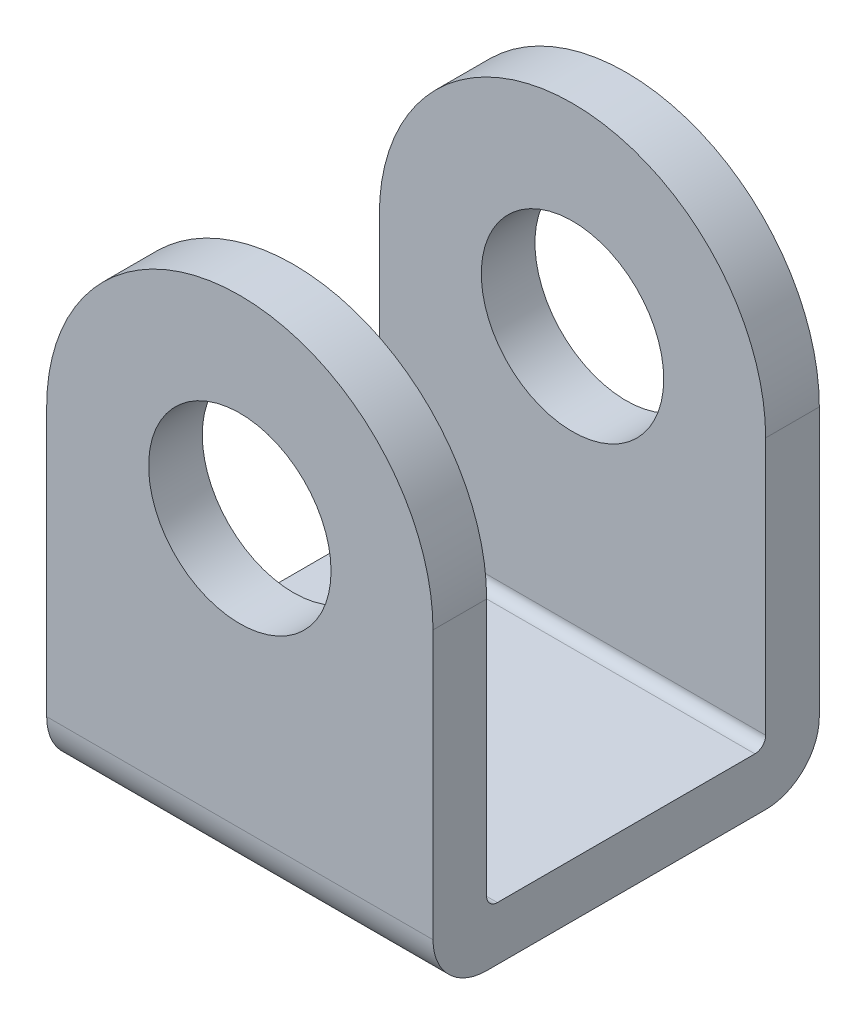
from build123d import *

# Parameters (mm, degrees)
ESQUISSE1_W             = 18
ESQUISSE1_H             = 2.5
BOSS_EXTRU_1_DEPTH      = 9
BOSS_EXTRU_2_DEPTH      = 2.5
ESQUISSE3_R             = 4.25
ENL_V_MAT_EXTRU_1_DEPTH = 32.320919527
CONG_1_R                = 0.5
CONG_2_R                = 2.5


with BuildPart() as part:
    # Esquisse1 → Boss.-Extru.1 (new, symmetric)
    with BuildSketch(Plane.XY):
        with Locations((0, 1.25)):
            Rectangle(ESQUISSE1_W, ESQUISSE1_H)
    extrude(amount=BOSS_EXTRU_1_DEPTH, both=True)

    # Esquisse2 → Boss.-Extru.2 (add)
    with BuildSketch(Plane.XY.offset(9)):
        with BuildLine():
            Line((-9, 2.5), (-9, 15))
            ThreePointArc((-9, 15), (0, 24), (9, 15))
            Line((9, 15), (9, 2.5))
            Line((9, 2.5), (-9, 2.5))
        make_face()
    boss_extru_2 = extrude(amount=-BOSS_EXTRU_2_DEPTH)

    # Sym_trie1: Boss.-Extru.2 across plane
    add(boss_extru_2.mirror(Plane.XY))

    # Esquisse3 → Enl_v. mat.-Extru.1 (cut, through all)
    with BuildSketch(Plane.XY.offset(9)):
        with Locations((0, 15)):
            Circle(ESQUISSE3_R)
    extrude(amount=-ENL_V_MAT_EXTRU_1_DEPTH, mode=Mode.SUBTRACT)

    # Cong_1
    cong_1_edges = [part.edges().sort_by_distance(p)[0] for p in [
        (0, 2.5, 6.5),
        (0, 2.5, -6.5),
    ]]
    fillet(cong_1_edges, radius=CONG_1_R)

    # Cong_2
    cong_2_edges = [part.edges().sort_by_distance(p)[0] for p in [
        (0, 0, -9),
        (0, 0, 9),
    ]]
    fillet(cong_2_edges, radius=CONG_2_R)


solid = part.part
